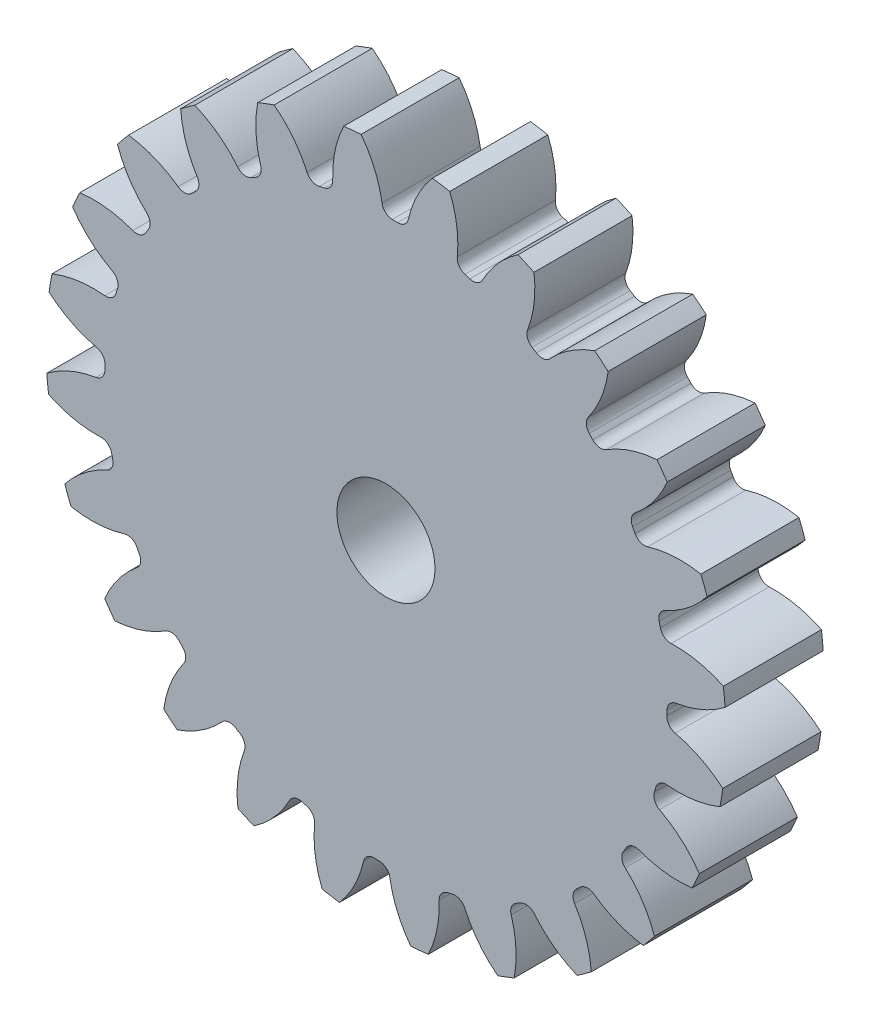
from build123d import *

# Parameters (mm, degrees)
SKETCH3_R         = 440.266666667
GEARBODY_DEPTH    = 127
TOOTHCUT_DEPTH    = 636.451395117
CIRPATTERN1_COUNT = 24
BOREDIA_R         = 63.5
BORE_DEPTH        = 12700


with BuildPart() as part:
    # Sketch3 → gearBody (new body)
    with BuildSketch(Plane.XY):
        Circle(SKETCH3_R)
    extrude(amount=GEARBODY_DEPTH)

    # Sketch2 → toothCut (cut, through all)
    with BuildSketch(Plane.XY):
        with BuildLine():
            ThreePointArc((363.758175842, -14.984234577), (363.881000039, -11.625643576), (363.972814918, -8.266061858))
            ThreePointArc((363.972814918, -8.266061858), (367.361901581, 0.477276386), (375.560199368, 5.029175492))
            ThreePointArc((375.560199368, 5.029175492), (409.670566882, 15.000553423), (440.266666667, 33.078833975))
            ThreePointArc((440.266666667, 33.078833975), (441.282424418, -14.098543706), (437.257269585, -61.114869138))
            ThreePointArc((437.257269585, -61.114869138), (407.877556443, -41.120419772), (374.473255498, -28.992013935))
            ThreePointArc((374.473255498, -28.992013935), (366.58223821, -23.926076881), (363.758175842, -14.984234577))
        make_face()
    toothcut = extrude(amount=TOOTHCUT_DEPTH, mode=Mode.SUBTRACT)

    # CirPattern1: toothCut ×24 about axis
    cirpattern1_axis = Axis((0, 0, 0), (0, 0, 1))
    for i in range(1, CIRPATTERN1_COUNT):
        add(toothcut.rotate(cirpattern1_axis, i * 360 / CIRPATTERN1_COUNT), mode=Mode.SUBTRACT)

    # boreDia → bore (cut, symmetric)
    with BuildSketch(Plane.XY):
        Circle(BOREDIA_R)
    extrude(amount=BORE_DEPTH, both=True, mode=Mode.SUBTRACT)


solid = part.part
